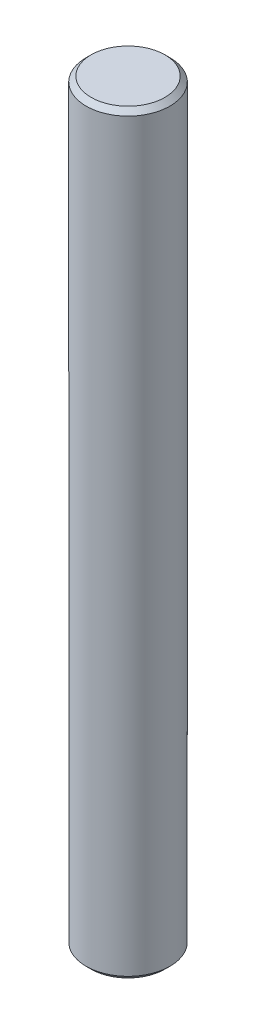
from build123d import *

# Parameters (mm, degrees)
SKETCH_1_R      = 2.5
EXTRUDE_1_DEPTH = 45
CHAMFER_1_SIZE  = 0.3


with BuildPart() as part:
    # Sketch 1 → Extrude 1 (new body)
    with BuildSketch(Plane(origin=(0, 0, 0), x_dir=(1, 0, 0), z_dir=(0, 1, 0))):
        with Locations(Location((0, 0, 0), (0, 0, 90))):
            Circle(SKETCH_1_R)
    extrude(amount=EXTRUDE_1_DEPTH)

    # Chamfer 1
    chamfer_1_edges = [part.edges().sort_by_distance(p)[0] for p in [
        (0, 0, 2.5),
        (0, 45, 2.5),
    ]]
    chamfer(chamfer_1_edges, length=CHAMFER_1_SIZE)


solid = part.part
